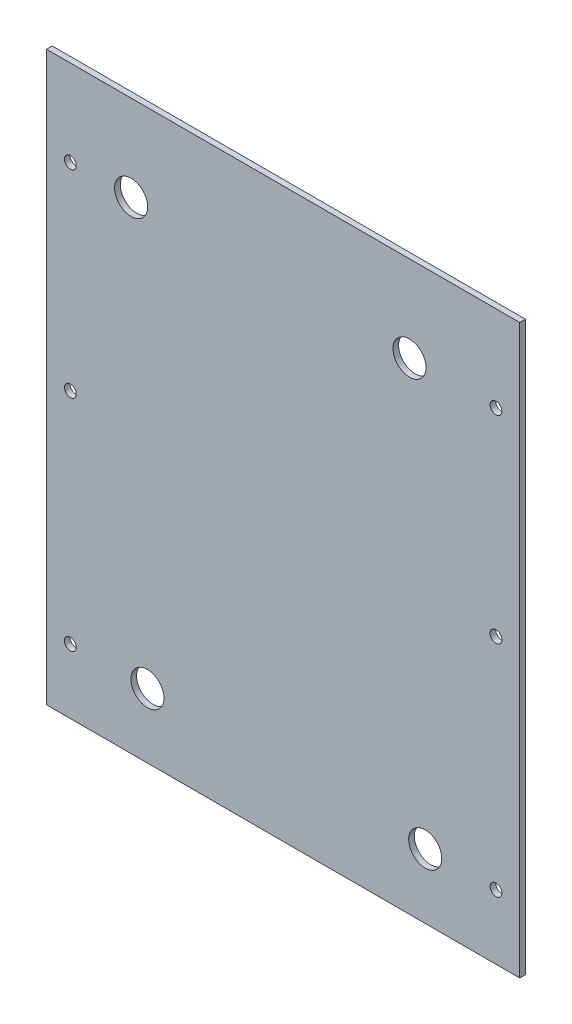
from build123d import *

# Parameters (mm, degrees)
SKETCH1_W           = 254
SKETCH1_H           = 304.8
SKETCH1_R           = 3.175
SKETCH1_R_2         = 8.89
BOSS_EXTRUDE1_DEPTH = 3.048


with BuildPart() as part:
    # Sketch1 → Boss-Extrude1 (new body)
    with BuildSketch(Plane.XY):
        Rectangle(SKETCH1_W, SKETCH1_H)
        with Locations(Location((-114.25593079, 106.23550215, 0), (0, 0, 180))):
            Circle(SKETCH1_R, mode=Mode.SUBTRACT)
        with Locations(Location((-114.25593079, 0, 0), (0, 0, 180))):
            Circle(SKETCH1_R, mode=Mode.SUBTRACT)
        with Locations(Location((-114.25593079, -117.773662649, 0), (0, 0, 180))):
            Circle(SKETCH1_R, mode=Mode.SUBTRACT)
        with Locations(Location((114.25593079, -117.773662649, 0), (0, 0, 180))):
            Circle(SKETCH1_R, mode=Mode.SUBTRACT)
        with Locations(Location((114.25593079, 0, 0), (0, 0, 180))):
            Circle(SKETCH1_R, mode=Mode.SUBTRACT)
        with Locations(Location((114.25593079, 106.23550215, 0), (0, 0, 180))):
            Circle(SKETCH1_R, mode=Mode.SUBTRACT)
        with Locations(Location((-81.611379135, 106.23550215, 0), (0, 0, 180))):
            Circle(SKETCH1_R_2, mode=Mode.SUBTRACT)
        with Locations(Location((67.821870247, 106.23550215, 0), (0, 0, 180))):
            Circle(SKETCH1_R_2, mode=Mode.SUBTRACT)
        with Locations(Location((-72.869266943, -117.773662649, 0), (0, 0, 180))):
            Circle(SKETCH1_R_2, mode=Mode.SUBTRACT)
        with Locations(Location((76.264426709, -117.773662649, 0), (0, 0, 180))):
            Circle(SKETCH1_R_2, mode=Mode.SUBTRACT)
    extrude(amount=BOSS_EXTRUDE1_DEPTH)


solid = part.part
